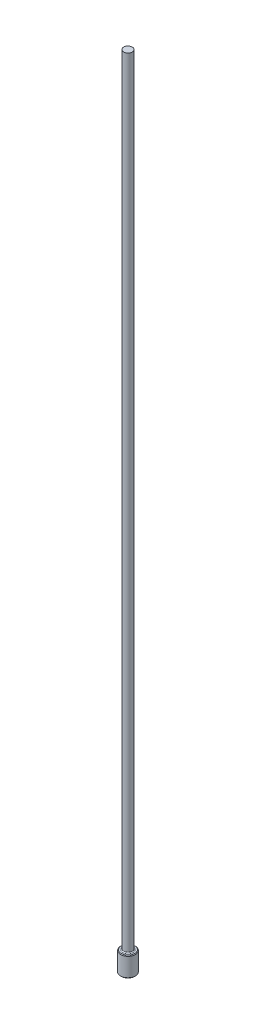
from build123d import *

# Parameters (mm, degrees)
CHAMFER1_SIZE = 0.0508
FILLET1_R     = 0.0762


with BuildPart() as part:
    # Sketch1 → Revolve1 (revolve)
    with BuildSketch(Plane.XY, mode=Mode.PRIVATE) as revolve1_sk:
        Polygon((0, 0), (-0.5842, 0), (-0.5842, 1.5748), (-0.3429, 1.5748), (-0.3429, 63.5), (0, 63.5), align=None)
    revolve(revolve1_sk.sketch.rotate(Axis((0, 259.958771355, 0), (0, -1, 0)), 270), axis=Axis((0, 259.958771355, 0), (0, -1, 0)))

    # Chamfer1
    chamfer1_edges = [part.edges().sort_by_distance(p)[0] for p in [
        (0, 1.5748, -0.5842),
        (0, 0, -0.5842),
    ]]
    chamfer(chamfer1_edges, length=CHAMFER1_SIZE)

    # Fillet1
    fillet1_edges = [part.edges().sort_by_distance(p)[0] for p in [
        (0, 1.5748, -0.3429),
    ]]
    fillet(fillet1_edges, radius=FILLET1_R)


solid = part.part
